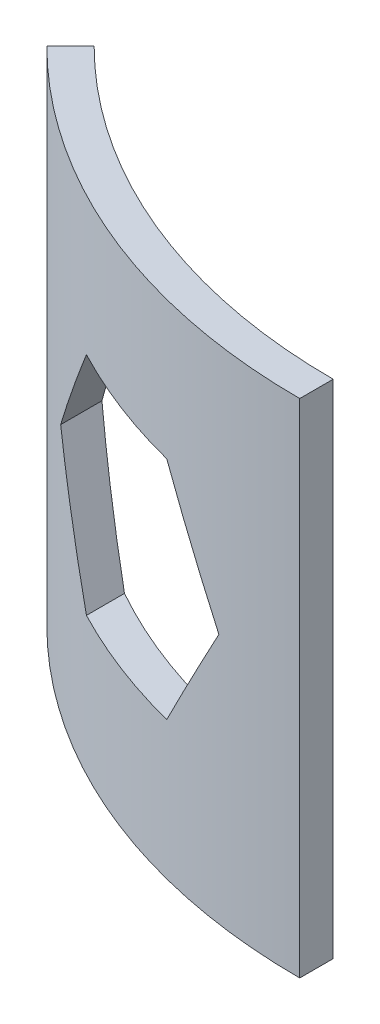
ISO-10303-21;
HEADER;
FILE_DESCRIPTION(('STEP AP214'),'2;1');
FILE_NAME('part.step','',(''),(''),'','','');
FILE_SCHEMA(('AUTOMOTIVE_DESIGN { 1 0 10303 214 1 1 1 1 }'));
ENDSEC;
DATA;
#1=APPLICATION_CONTEXT('core data for automotive mechanical design processes');
#2=APPLICATION_PROTOCOL_DEFINITION('international standard','automotive_design',2000,#1);
#3=PRODUCT_CONTEXT('',#1,'mechanical');
#4=PRODUCT('Part','Part','',(#3));
#5=PRODUCT_RELATED_PRODUCT_CATEGORY('part','',(#4));
#6=PRODUCT_DEFINITION_FORMATION('','',#4);
#7=PRODUCT_DEFINITION_CONTEXT('part definition',#1,'design');
#8=PRODUCT_DEFINITION('design','',#6,#7);
#9=PRODUCT_DEFINITION_SHAPE('','',#8);
#10=(LENGTH_UNIT() NAMED_UNIT(*) SI_UNIT(.MILLI.,.METRE.));
#11=(NAMED_UNIT(*) PLANE_ANGLE_UNIT() SI_UNIT($,.RADIAN.));
#12=(NAMED_UNIT(*) SI_UNIT($,.STERADIAN.) SOLID_ANGLE_UNIT());
#13=UNCERTAINTY_MEASURE_WITH_UNIT(LENGTH_MEASURE(1.E-05),#10,'distance_accuracy_value','');
#14=(GEOMETRIC_REPRESENTATION_CONTEXT(3) GLOBAL_UNCERTAINTY_ASSIGNED_CONTEXT((#13)) GLOBAL_UNIT_ASSIGNED_CONTEXT((#10,
#11,#12)) REPRESENTATION_CONTEXT('',''));
#15=CARTESIAN_POINT('',(0.,0.,0.));
#16=DIRECTION('',(0.,0.,1.));
#17=DIRECTION('',(1.,0.,0.));
#18=AXIS2_PLACEMENT_3D('',#15,#16,#17);
#19=CARTESIAN_POINT('',(0.,3000.,0.));
#20=DIRECTION('',(0.,-1.,0.));
#21=DIRECTION('',(0.,0.,-1.));
#22=AXIS2_PLACEMENT_3D('',#19,#20,#21);
#23=CYLINDRICAL_SURFACE('',#22,3450.);
#24=CARTESIAN_POINT('',(0.,598.333950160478,0.));
#25=DIRECTION('',(0.866025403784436,0.500000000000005,0.));
#26=DIRECTION('',(0.500000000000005,-0.866025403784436,0.));
#27=AXIS2_PLACEMENT_3D('',#24,#25,#26);
#28=ELLIPSE('',#27,6899.99999999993,3450.);
#29=CARTESIAN_POINT('',(-910.288568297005,2175.,3327.74318757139));
#30=VERTEX_POINT('',#29);
#31=CARTESIAN_POINT('',(-520.577136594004,1500.,3410.49841589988));
#32=VERTEX_POINT('',#31);
#33=EDGE_CURVE('E265',#30,#32,#28,.T.);
#34=ORIENTED_EDGE('',*,*,#33,.F.);
#35=CARTESIAN_POINT('',(0.,2175.,0.));
#36=DIRECTION('',(0.,1.,0.));
#37=DIRECTION('',(-1.,0.,0.));
#38=AXIS2_PLACEMENT_3D('',#35,#36,#37);
#39=CIRCLE('',#38,3450.);
#40=CARTESIAN_POINT('',(-1689.711431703,2175.,3007.88551603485));
#41=VERTEX_POINT('',#40);
#42=EDGE_CURVE('E261',#41,#30,#39,.T.);
#43=ORIENTED_EDGE('',*,*,#42,.F.);
#44=CARTESIAN_POINT('',(0.,5101.66604983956,0.));
#45=DIRECTION('',(-0.86602540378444,0.499999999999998,0.));
#46=DIRECTION('',(-0.499999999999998,-0.86602540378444,0.));
#47=AXIS2_PLACEMENT_3D('',#44,#45,#46);
#48=ELLIPSE('',#47,6900.00000000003,3450.);
#49=CARTESIAN_POINT('',(-2079.42286340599,1500.,2752.90765467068));
#50=VERTEX_POINT('',#49);
#51=EDGE_CURVE('E259',#50,#41,#48,.T.);
#52=ORIENTED_EDGE('',*,*,#51,.F.);
#53=CARTESIAN_POINT('',(0.,-2101.66604983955,0.));
#54=DIRECTION('',(-0.866025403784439,-0.5,0.));
#55=DIRECTION('',(0.5,-0.866025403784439,0.));
#56=AXIS2_PLACEMENT_3D('',#53,#54,#55);
#57=ELLIPSE('',#56,6900.00000000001,3450.);
#58=CARTESIAN_POINT('',(-1689.711431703,825.,3007.88551603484));
#59=VERTEX_POINT('',#58);
#60=EDGE_CURVE('E269',#59,#50,#57,.T.);
#61=ORIENTED_EDGE('',*,*,#60,.F.);
#62=CARTESIAN_POINT('',(0.,825.000000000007,0.));
#63=DIRECTION('',(0.,-1.,0.));
#64=DIRECTION('',(1.,0.,0.));
#65=AXIS2_PLACEMENT_3D('',#62,#63,#64);
#66=CIRCLE('',#65,3450.);
#67=CARTESIAN_POINT('',(-910.288568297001,825.000000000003,3327.74318757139));
#68=VERTEX_POINT('',#67);
#69=EDGE_CURVE('E133',#68,#59,#66,.T.);
#70=ORIENTED_EDGE('',*,*,#69,.F.);
#71=CARTESIAN_POINT('',(0.,2401.66604983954,0.));
#72=DIRECTION('',(0.866025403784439,-0.5,0.));
#73=DIRECTION('',(-0.5,-0.866025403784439,0.));
#74=AXIS2_PLACEMENT_3D('',#71,#72,#73);
#75=ELLIPSE('',#74,6900.00000000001,3450.);
#76=EDGE_CURVE('E143',#32,#68,#75,.T.);
#77=ORIENTED_EDGE('',*,*,#76,.F.);
#78=EDGE_LOOP('',(#34,#43,#52,#61,#70,#77));
#79=FACE_BOUND('',#78,.T.);
#80=CARTESIAN_POINT('',(0.,0.,0.));
#81=DIRECTION('',(0.,1.,0.));
#82=DIRECTION('',(0.,0.,1.));
#83=AXIS2_PLACEMENT_3D('',#80,#81,#82);
#84=CIRCLE('',#83,3450.);
#85=CARTESIAN_POINT('',(-2439.51839509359,0.,2439.51839509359));
#86=VERTEX_POINT('',#85);
#87=CARTESIAN_POINT('',(0.,0.,3450.));
#88=VERTEX_POINT('',#87);
#89=EDGE_CURVE('E267',#86,#88,#84,.T.);
#90=ORIENTED_EDGE('',*,*,#89,.F.);
#91=DIRECTION('',(0.,-1.,0.));
#92=VECTOR('',#91,1.);
#93=CARTESIAN_POINT('',(-2439.51839509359,3000.,2439.51839509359));
#94=LINE('',#93,#92);
#95=CARTESIAN_POINT('',(-2439.51839509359,3000.,2439.51839509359));
#96=VERTEX_POINT('',#95);
#97=EDGE_CURVE('E11',#96,#86,#94,.T.);
#98=ORIENTED_EDGE('',*,*,#97,.F.);
#99=CARTESIAN_POINT('',(0.,3000.,0.));
#100=DIRECTION('',(0.,1.,0.));
#101=DIRECTION('',(0.,0.,1.));
#102=AXIS2_PLACEMENT_3D('',#99,#100,#101);
#103=CIRCLE('',#102,3450.);
#104=CARTESIAN_POINT('',(0.,3000.,3450.));
#105=VERTEX_POINT('',#104);
#106=EDGE_CURVE('E273',#96,#105,#103,.T.);
#107=ORIENTED_EDGE('',*,*,#106,.T.);
#108=DIRECTION('',(0.,-1.,0.));
#109=VECTOR('',#108,1.);
#110=CARTESIAN_POINT('',(0.,3000.,3450.));
#111=LINE('',#110,#109);
#112=EDGE_CURVE('E284',#105,#88,#111,.T.);
#113=ORIENTED_EDGE('',*,*,#112,.T.);
#114=EDGE_LOOP('',(#90,#98,#107,#113));
#115=FACE_BOUND('',#114,.T.);
#116=ADVANCED_FACE('F35',(#79,#115),#23,.F.);
#117=CARTESIAN_POINT('',(0.,3000.,0.));
#118=DIRECTION('',(0.707106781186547,0.,0.707106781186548));
#119=DIRECTION('',(0.707106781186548,0.,-0.707106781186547));
#120=AXIS2_PLACEMENT_3D('',#117,#118,#119);
#121=PLANE('',#120);
#122=DIRECTION('',(-0.707106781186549,0.,0.707106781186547));
#123=VECTOR('',#122,1.);
#124=CARTESIAN_POINT('',(0.,0.,0.));
#125=LINE('',#124,#123);
#126=CARTESIAN_POINT('',(-2580.9397513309,0.,2580.93975133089));
#127=VERTEX_POINT('',#126);
#128=EDGE_CURVE('E287',#86,#127,#125,.T.);
#129=ORIENTED_EDGE('',*,*,#128,.T.);
#130=DIRECTION('',(0.,-1.,0.));
#131=VECTOR('',#130,1.);
#132=CARTESIAN_POINT('',(-2580.9397513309,3000.,2580.93975133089));
#133=LINE('',#132,#131);
#134=CARTESIAN_POINT('',(-2580.9397513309,3000.,2580.93975133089));
#135=VERTEX_POINT('',#134);
#136=EDGE_CURVE('E45',#135,#127,#133,.T.);
#137=ORIENTED_EDGE('',*,*,#136,.F.);
#138=DIRECTION('',(-0.707106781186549,0.,0.707106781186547));
#139=VECTOR('',#138,1.);
#140=CARTESIAN_POINT('',(0.,3000.,0.));
#141=LINE('',#140,#139);
#142=EDGE_CURVE('E276',#96,#135,#141,.T.);
#143=ORIENTED_EDGE('',*,*,#142,.F.);
#144=ORIENTED_EDGE('',*,*,#97,.T.);
#145=EDGE_LOOP('',(#129,#137,#143,#144));
#146=FACE_BOUND('',#145,.T.);
#147=ADVANCED_FACE('F180',(#146),#121,.F.);
#148=CARTESIAN_POINT('',(0.,3000.,0.));
#149=DIRECTION('',(0.,-1.,0.));
#150=DIRECTION('',(0.,0.,-1.));
#151=AXIS2_PLACEMENT_3D('',#148,#149,#150);
#152=CYLINDRICAL_SURFACE('',#151,3650.);
#153=CARTESIAN_POINT('',(0.,2175.,0.));
#154=DIRECTION('',(0.,1.,0.));
#155=DIRECTION('',(0.,0.,1.));
#156=AXIS2_PLACEMENT_3D('',#153,#154,#155);
#157=CIRCLE('',#156,3650.);
#158=CARTESIAN_POINT('',(-1689.711431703,2175.,3235.33232876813));
#159=VERTEX_POINT('',#158);
#160=CARTESIAN_POINT('',(-910.288568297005,2175.,3534.66755472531));
#161=VERTEX_POINT('',#160);
#162=EDGE_CURVE('E200',#159,#161,#157,.T.);
#163=ORIENTED_EDGE('',*,*,#162,.T.);
#164=CARTESIAN_POINT('',(-910.288568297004,2175.,3534.66755472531));
#165=CARTESIAN_POINT('',(-902.373529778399,2161.29074530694,3536.70592604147));
#166=CARTESIAN_POINT('',(-894.456700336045,2147.57837923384,3538.71641189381));
#167=CARTESIAN_POINT('',(-878.534582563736,2120.00043409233,3542.70307281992));
#168=CARTESIAN_POINT('',(-870.52925667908,2106.13479000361,3544.6786481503));
#169=CARTESIAN_POINT('',(-854.430133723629,2078.25028967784,3548.59387651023));
#170=CARTESIAN_POINT('',(-846.336299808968,2064.23136988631,3550.53292537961));
#171=CARTESIAN_POINT('',(-830.060168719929,2036.04031610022,3554.373470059));
#172=CARTESIAN_POINT('',(-821.877835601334,2021.86811993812,3556.27435723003));
#173=CARTESIAN_POINT('',(-805.741931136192,1993.91991180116,3559.96439309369));
#174=CARTESIAN_POINT('',(-797.788453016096,1980.14406249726,3561.75518182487));
#175=CARTESIAN_POINT('',(-781.7839391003,1952.42339650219,3565.30249069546));
#176=CARTESIAN_POINT('',(-773.73286670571,1938.47851651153,3567.05835108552));
#177=CARTESIAN_POINT('',(-757.533152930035,1910.41978824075,3570.53398712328));
#178=CARTESIAN_POINT('',(-749.384475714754,1896.30587820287,3572.25309715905));
#179=CARTESIAN_POINT('',(-732.989560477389,1867.90908818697,3575.65339538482));
#180=CARTESIAN_POINT('',(-724.7432875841,1853.62614792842,3577.33391206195));
#181=CARTESIAN_POINT('',(-708.517290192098,1825.52189362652,3580.58227854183));
#182=CARTESIAN_POINT('',(-700.537659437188,1811.70074353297,3582.15201551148));
#183=CARTESIAN_POINT('',(-684.468750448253,1783.86853684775,3585.2573669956));
#184=CARTESIAN_POINT('',(-676.379436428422,1769.85741839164,3586.79224191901));
#185=CARTESIAN_POINT('',(-660.09114793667,1741.64527404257,3589.82579089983));
#186=CARTESIAN_POINT('',(-651.892138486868,1727.44418796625,3591.32371741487));
#187=CARTESIAN_POINT('',(-635.384468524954,1698.85210661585,3594.28126399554));
#188=CARTESIAN_POINT('',(-627.075774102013,1684.46105276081,3595.74012852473));
#189=CARTESIAN_POINT('',(-610.774089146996,1656.22570291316,3598.54425703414));
#190=CARTESIAN_POINT('',(-602.781192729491,1642.38157208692,3599.89173190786));
#191=CARTESIAN_POINT('',(-586.669099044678,1614.47456014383,3602.55285442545));
#192=CARTESIAN_POINT('',(-578.5498666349,1600.41161830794,3603.86565263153));
#193=CARTESIAN_POINT('',(-562.185084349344,1572.06698410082,3606.4549912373));
#194=CARTESIAN_POINT('',(-553.939500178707,1557.78523291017,3607.73067100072));
#195=CARTESIAN_POINT('',(-537.322030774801,1529.00297520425,3610.24330282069));
#196=CARTESIAN_POINT('',(-528.950112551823,1514.50241161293,3611.47938295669));
#197=CARTESIAN_POINT('',(-520.577136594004,1500.00000000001,3612.68590453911));
#198=B_SPLINE_CURVE_WITH_KNOTS('',3,(#164,#165,#166,#167,#168,#169,#170,#171,#172,#173,#174,
#175,#176,#177,#178,#179,#180,#181,#182,#183,#184,#185,#186,#187,#188,#189,#190,#191,#192,#193,
#194,#195,#196,#197),.UNSPECIFIED.,.F.,.F.,(4,2,2,2,2,2,2,2,2,2,2,2,2,2,2,2,4),(0.,
47.8823104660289,96.2784696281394,145.188503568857,194.612437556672,242.634720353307,
291.22744321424,340.39062642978,390.124289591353,438.23308192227,486.986840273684,
536.385579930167,586.429315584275,634.55674557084,683.431032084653,733.052186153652,
783.420218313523),.UNSPECIFIED.);
#199=CARTESIAN_POINT('',(-520.577136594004,1500.,3612.68590453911));
#200=VERTEX_POINT('',#199);
#201=EDGE_CURVE('E199',#161,#200,#198,.T.);
#202=ORIENTED_EDGE('',*,*,#201,.T.);
#203=CARTESIAN_POINT('',(-520.577136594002,1500.,3612.68590453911));
#204=CARTESIAN_POINT('',(-528.950073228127,1485.49765650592,3611.4793886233));
#205=CARTESIAN_POINT('',(-537.32195217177,1470.99716103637,3610.24331442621));
#206=CARTESIAN_POINT('',(-553.939369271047,1442.21499415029,3607.73069106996));
#207=CARTESIAN_POINT('',(-562.18494040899,1427.93326566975,3606.45501364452));
#208=CARTESIAN_POINT('',(-578.54972281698,1399.58863146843,3603.86567574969));
#209=CARTESIAN_POINT('',(-586.668968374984,1385.52566694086,3602.55287573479));
#210=CARTESIAN_POINT('',(-602.781114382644,1357.61856415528,3599.89174511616));
#211=CARTESIAN_POINT('',(-610.774049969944,1343.77436519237,3598.54426377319));
#212=CARTESIAN_POINT('',(-627.075700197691,1315.53907498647,3595.74014123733));
#213=CARTESIAN_POINT('',(-635.384320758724,1301.14814885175,3594.2812899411));
#214=CARTESIAN_POINT('',(-651.89189241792,1272.55623779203,3591.32376202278));
#215=CARTESIAN_POINT('',(-660.090877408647,1258.3551943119,3589.82584058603));
#216=CARTESIAN_POINT('',(-676.379166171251,1230.14304997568,3586.79229294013));
#217=CARTESIAN_POINT('',(-684.46850490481,1216.13188896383,3585.25741392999));
#218=CARTESIAN_POINT('',(-700.537512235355,1188.29951193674,3582.15204446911));
#219=CARTESIAN_POINT('',(-708.51721660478,1174.47823408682,3580.58229327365));
#220=CARTESIAN_POINT('',(-724.743214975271,1146.37397756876,3577.33392659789));
#221=CARTESIAN_POINT('',(-732.98941528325,1132.09116276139,3575.6534249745));
#222=CARTESIAN_POINT('',(-749.38423395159,1103.69454001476,3572.25314781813));
#223=CARTESIAN_POINT('',(-757.532887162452,1089.58067182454,3570.53404345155));
#224=CARTESIAN_POINT('',(-773.732601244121,1061.52194356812,3567.05840872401));
#225=CARTESIAN_POINT('',(-781.783697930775,1047.57702177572,3565.30254363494));
#226=CARTESIAN_POINT('',(-797.788308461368,1019.85618845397,3561.75521437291));
#227=CARTESIAN_POINT('',(-805.741858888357,1006.08021365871,3559.96440961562));
#228=CARTESIAN_POINT('',(-821.877801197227,978.131939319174,3556.27436509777));
#229=CARTESIAN_POINT('',(-830.060099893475,963.959802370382,3554.37348604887));
#230=CARTESIAN_POINT('',(-846.336185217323,935.768827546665,3550.53295266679));
#231=CARTESIAN_POINT('',(-854.43000777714,921.749927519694,3548.59390680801));
#232=CARTESIAN_POINT('',(-870.529130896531,893.865427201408,3544.67867906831));
#233=CARTESIAN_POINT('',(-878.534468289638,879.999763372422,3542.70310118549));
#234=CARTESIAN_POINT('',(-894.456631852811,852.421739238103,3538.71642928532));
#235=CARTESIAN_POINT('',(-902.373495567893,838.709313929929,3536.70593485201));
#236=CARTESIAN_POINT('',(-910.288568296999,825.000000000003,3534.66755472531));
#237=B_SPLINE_CURVE_WITH_KNOTS('',3,(#203,#204,#205,#206,#207,#208,#209,#210,#211,#212,#213,
#214,#215,#216,#217,#218,#219,#220,#221,#222,#223,#224,#225,#226,#227,#228,#229,#230,#231,#232,
#233,#234,#235,#236),.UNSPECIFIED.,.F.,.F.,(4,2,2,2,2,2,2,2,2,2,2,2,2,2,2,2,4),(0.,
50.3677955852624,99.9888707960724,148.863236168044,196.990902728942,247.034193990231,
296.432785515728,345.186691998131,393.295928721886,443.029154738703,492.192192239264,
540.785060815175,588.80778075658,638.231507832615,687.141472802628,735.537700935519,
783.420218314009),.UNSPECIFIED.);
#238=CARTESIAN_POINT('',(-910.288568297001,825.000000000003,3534.66755472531));
#239=VERTEX_POINT('',#238);
#240=EDGE_CURVE('E140',#200,#239,#237,.T.);
#241=ORIENTED_EDGE('',*,*,#240,.T.);
#242=CARTESIAN_POINT('',(0.,825.,0.));
#243=DIRECTION('',(0.,-1.,0.));
#244=DIRECTION('',(1.,0.,0.));
#245=AXIS2_PLACEMENT_3D('',#242,#243,#244);
#246=CIRCLE('',#245,3650.);
#247=CARTESIAN_POINT('',(-1689.711431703,825.,3235.33232876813));
#248=VERTEX_POINT('',#247);
#249=EDGE_CURVE('E130',#239,#248,#246,.T.);
#250=ORIENTED_EDGE('',*,*,#249,.T.);
#251=CARTESIAN_POINT('',(-1689.711431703,825.,3235.33232876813));
#252=CARTESIAN_POINT('',(-1698.17448306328,839.658430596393,3230.91234217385));
#253=CARTESIAN_POINT('',(-1706.63237423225,854.307915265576,3226.4527928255));
#254=CARTESIAN_POINT('',(-1723.4727558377,883.476288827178,3217.48845473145));
#255=CARTESIAN_POINT('',(-1731.85532729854,897.995318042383,3212.98427475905));
#256=CARTESIAN_POINT('',(-1748.54506015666,926.902782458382,3203.93189645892));
#257=CARTESIAN_POINT('',(-1756.85230410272,941.291360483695,3199.38430645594));
#258=CARTESIAN_POINT('',(-1773.39138754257,969.93791853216,3190.24631534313));
#259=CARTESIAN_POINT('',(-1781.62331103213,984.196043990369,3185.65652219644));
#260=CARTESIAN_POINT('',(-1798.16576947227,1012.84842415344,3176.34867661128));
#261=CARTESIAN_POINT('',(-1806.47618468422,1027.24247113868,3171.6297718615));
#262=CARTESIAN_POINT('',(-1823.02307366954,1055.9025001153,3162.1475480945));
#263=CARTESIAN_POINT('',(-1831.25963353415,1070.1686311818,3157.38482990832));
#264=CARTESIAN_POINT('',(-1847.65880348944,1098.572826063,3147.81612953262));
#265=CARTESIAN_POINT('',(-1855.82150126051,1112.71104161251,3143.01074806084));
#266=CARTESIAN_POINT('',(-1872.07295165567,1140.85940242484,3133.35786389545));
#267=CARTESIAN_POINT('',(-1880.16179349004,1154.86970215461,3128.5109618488));
#268=CARTESIAN_POINT('',(-1896.40618019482,1183.00580683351,3118.69115978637));
#269=CARTESIAN_POINT('',(-1904.56160932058,1197.13141103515,3113.71749304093));
#270=CARTESIAN_POINT('',(-1920.79966762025,1225.25653106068,3103.72660448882));
#271=CARTESIAN_POINT('',(-1928.8823884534,1239.25620560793,3098.7099784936));
#272=CARTESIAN_POINT('',(-1944.97502208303,1267.1294639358,3088.63426341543));
#273=CARTESIAN_POINT('',(-1952.98502821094,1281.00320924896,3083.57577029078));
#274=CARTESIAN_POINT('',(-1968.93223655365,1308.62460590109,3073.41740604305));
#275=CARTESIAN_POINT('',(-1976.86953372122,1322.37242165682,3068.31813106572));
#276=CARTESIAN_POINT('',(-1992.7999448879,1349.96470487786,3057.99595142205));
#277=CARTESIAN_POINT('',(-2000.79294755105,1363.80897927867,3052.77235878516));
#278=CARTESIAN_POINT('',(-2016.70702923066,1391.37295701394,3042.28251721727));
#279=CARTESIAN_POINT('',(-2024.62820601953,1405.09282966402,3037.01686154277));
#280=CARTESIAN_POINT('',(-2040.39862838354,1432.40800265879,3026.44393576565));
#281=CARTESIAN_POINT('',(-2048.24797349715,1446.00347529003,3021.137259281));
#282=CARTESIAN_POINT('',(-2063.87473608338,1473.06983995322,3010.4833211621));
#283=CARTESIAN_POINT('',(-2071.65225482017,1486.54090736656,3005.13665359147));
#284=CARTESIAN_POINT('',(-2079.42286340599,1500.,2999.75008211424));
#285=B_SPLINE_CURVE_WITH_KNOTS('',3,(#251,#252,#253,#254,#255,#256,#257,#258,#259,#260,#261,
#262,#263,#264,#265,#266,#267,#268,#269,#270,#271,#272,#273,#274,#275,#276,#277,#278,#279,#280,
#281,#282,#283,#284),.UNSPECIFIED.,.F.,.F.,(4,2,2,2,2,2,2,2,2,2,2,2,2,2,2,2,4),(0.,
52.4810201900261,104.559771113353,156.236446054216,207.511242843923,259.344206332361,
310.787395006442,361.841032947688,412.5053494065,463.662054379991,514.439699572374,
564.838543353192,614.858849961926,665.311993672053,715.395346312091,765.109204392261,
814.453871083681),.UNSPECIFIED.);
#286=CARTESIAN_POINT('',(-2079.42286340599,1500.,2999.75008211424));
#287=VERTEX_POINT('',#286);
#288=EDGE_CURVE('E114',#248,#287,#285,.T.);
#289=ORIENTED_EDGE('',*,*,#288,.T.);
#290=CARTESIAN_POINT('',(-2079.42286340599,1500.,2999.75008211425));
#291=CARTESIAN_POINT('',(-2071.65229052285,1513.45903084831,3005.13662884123));
#292=CARTESIAN_POINT('',(-2063.87480769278,1526.9300364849,3010.48327193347));
#293=CARTESIAN_POINT('',(-2048.24809329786,1553.99631872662,3021.13717801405));
#294=CARTESIAN_POINT('',(-2040.39876042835,1567.59177078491,3026.44384669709));
#295=CARTESIAN_POINT('',(-2024.62833860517,1594.90694381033,3037.01677319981));
#296=CARTESIAN_POINT('',(-2016.70715007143,1608.6268371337,3042.28243715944));
#297=CARTESIAN_POINT('',(-2000.79302030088,1636.19089716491,3052.77231123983));
#298=CARTESIAN_POINT('',(-1992.79998124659,1650.03523325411,3057.99592786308));
#299=CARTESIAN_POINT('',(-1976.86960780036,1677.62744893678,3068.31808306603));
#300=CARTESIAN_POINT('',(-1968.93238492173,1691.3751351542,3073.41731072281));
#301=CARTESIAN_POINT('',(-1952.98527633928,1718.99635906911,3083.57561304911));
#302=CARTESIAN_POINT('',(-1944.97529561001,1732.87006132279,3088.63409107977));
#303=CARTESIAN_POINT('',(-1928.88266302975,1760.7433197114,3098.70980766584));
#304=CARTESIAN_POINT('',(-1920.79991777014,1774.74303751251,3103.72644977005));
#305=CARTESIAN_POINT('',(-1904.56175989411,1802.86833003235,3113.71740121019));
#306=CARTESIAN_POINT('',(-1896.40625553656,1816.99406360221,3118.69111424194));
#307=CARTESIAN_POINT('',(-1880.1618686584,1845.13016672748,3128.51091640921));
#308=CARTESIAN_POINT('',(-1872.07310210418,1859.14033515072,3133.35777374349));
#309=CARTESIAN_POINT('',(-1855.82175277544,1887.28852088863,3143.01059946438));
#310=CARTESIAN_POINT('',(-1847.65908072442,1901.42669279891,3147.81596671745));
#311=CARTESIAN_POINT('',(-1831.25991176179,1929.83088773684,3157.38466862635));
#312=CARTESIAN_POINT('',(-1823.02332709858,1944.09706262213,3162.14740207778));
#313=CARTESIAN_POINT('',(-1806.47633721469,1972.75726644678,3171.62968524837));
#314=CARTESIAN_POINT('',(-1798.16584582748,1987.15144457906,3176.3486336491));
#315=CARTESIAN_POINT('',(-1781.62334983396,2015.80388782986,3185.6565003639));
#316=CARTESIAN_POINT('',(-1773.39146512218,2030.06194496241,3190.24627208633));
#317=CARTESIAN_POINT('',(-1756.85243376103,2058.70841194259,3199.38423521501));
#318=CARTESIAN_POINT('',(-1748.54520308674,2073.09696728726,3203.93181841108));
#319=CARTESIAN_POINT('',(-1731.85547070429,2102.00443172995,3212.98419750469));
#320=CARTESIAN_POINT('',(-1723.47288641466,2116.52348371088,3217.4883848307));
#321=CARTESIAN_POINT('',(-1706.63245281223,2145.6919482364,3226.45275139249));
#322=CARTESIAN_POINT('',(-1698.1745224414,2160.34150116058,3230.91232160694));
#323=CARTESIAN_POINT('',(-1689.711431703,2175.,3235.33232876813));
#324=B_SPLINE_CURVE_WITH_KNOTS('',3,(#290,#291,#292,#293,#294,#295,#296,#297,#298,#299,#300,
#301,#302,#303,#304,#305,#306,#307,#308,#309,#310,#311,#312,#313,#314,#315,#316,#317,#318,#319,
#320,#321,#322,#323),.UNSPECIFIED.,.F.,.F.,(4,2,2,2,2,2,2,2,2,2,2,2,2,2,2,2,4),(0.,
49.3444401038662,99.0582226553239,149.141650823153,199.595021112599,249.614857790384,
300.013544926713,350.7913467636,401.948521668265,452.612364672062,503.665844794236,
555.109191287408,606.942628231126,658.217180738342,709.89377425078,761.972606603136,
814.45387108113),.UNSPECIFIED.);
#325=EDGE_CURVE('E134',#287,#159,#324,.T.);
#326=ORIENTED_EDGE('',*,*,#325,.T.);
#327=EDGE_LOOP('',(#163,#202,#241,#250,#289,#326));
#328=FACE_BOUND('',#327,.T.);
#329=CARTESIAN_POINT('',(0.,0.,0.));
#330=DIRECTION('',(0.,1.,0.));
#331=DIRECTION('',(0.,0.,1.));
#332=AXIS2_PLACEMENT_3D('',#329,#330,#331);
#333=CIRCLE('',#332,3650.);
#334=CARTESIAN_POINT('',(0.,0.,3650.));
#335=VERTEX_POINT('',#334);
#336=EDGE_CURVE('E289',#127,#335,#333,.T.);
#337=ORIENTED_EDGE('',*,*,#336,.T.);
#338=DIRECTION('',(0.,-1.,0.));
#339=VECTOR('',#338,1.);
#340=CARTESIAN_POINT('',(0.,3000.,3650.));
#341=LINE('',#340,#339);
#342=CARTESIAN_POINT('',(0.,3000.,3650.));
#343=VERTEX_POINT('',#342);
#344=EDGE_CURVE('E295',#343,#335,#341,.T.);
#345=ORIENTED_EDGE('',*,*,#344,.F.);
#346=CARTESIAN_POINT('',(0.,3000.,0.));
#347=DIRECTION('',(0.,1.,0.));
#348=DIRECTION('',(0.,0.,1.));
#349=AXIS2_PLACEMENT_3D('',#346,#347,#348);
#350=CIRCLE('',#349,3650.);
#351=EDGE_CURVE('E279',#135,#343,#350,.T.);
#352=ORIENTED_EDGE('',*,*,#351,.F.);
#353=ORIENTED_EDGE('',*,*,#136,.T.);
#354=EDGE_LOOP('',(#337,#345,#352,#353));
#355=FACE_BOUND('',#354,.T.);
#356=ADVANCED_FACE('F137',(#328,#355),#152,.T.);
#357=CARTESIAN_POINT('',(0.,3000.,0.));
#358=DIRECTION('',(1.,0.,0.));
#359=DIRECTION('',(0.,0.,-1.));
#360=AXIS2_PLACEMENT_3D('',#357,#358,#359);
#361=PLANE('',#360);
#362=DIRECTION('',(0.,0.,1.));
#363=VECTOR('',#362,1.);
#364=CARTESIAN_POINT('',(0.,0.,0.));
#365=LINE('',#364,#363);
#366=EDGE_CURVE('E277',#88,#335,#365,.T.);
#367=ORIENTED_EDGE('',*,*,#366,.F.);
#368=ORIENTED_EDGE('',*,*,#112,.F.);
#369=DIRECTION('',(0.,0.,1.));
#370=VECTOR('',#369,1.);
#371=CARTESIAN_POINT('',(0.,3000.,0.));
#372=LINE('',#371,#370);
#373=EDGE_CURVE('E281',#105,#343,#372,.T.);
#374=ORIENTED_EDGE('',*,*,#373,.T.);
#375=ORIENTED_EDGE('',*,*,#344,.T.);
#376=EDGE_LOOP('',(#367,#368,#374,#375));
#377=FACE_BOUND('',#376,.T.);
#378=ADVANCED_FACE('F170',(#377),#361,.T.);
#379=CARTESIAN_POINT('',(0.,3000.,0.));
#380=DIRECTION('',(0.,1.,0.));
#381=DIRECTION('',(0.,0.,1.));
#382=AXIS2_PLACEMENT_3D('',#379,#380,#381);
#383=PLANE('',#382);
#384=ORIENTED_EDGE('',*,*,#106,.F.);
#385=ORIENTED_EDGE('',*,*,#142,.T.);
#386=ORIENTED_EDGE('',*,*,#351,.T.);
#387=ORIENTED_EDGE('',*,*,#373,.F.);
#388=EDGE_LOOP('',(#384,#385,#386,#387));
#389=FACE_BOUND('',#388,.T.);
#390=ADVANCED_FACE('F167',(#389),#383,.T.);
#391=CARTESIAN_POINT('',(0.,0.,0.));
#392=DIRECTION('',(0.,1.,0.));
#393=DIRECTION('',(0.,0.,1.));
#394=AXIS2_PLACEMENT_3D('',#391,#392,#393);
#395=PLANE('',#394);
#396=ORIENTED_EDGE('',*,*,#89,.T.);
#397=ORIENTED_EDGE('',*,*,#366,.T.);
#398=ORIENTED_EDGE('',*,*,#336,.F.);
#399=ORIENTED_EDGE('',*,*,#128,.F.);
#400=EDGE_LOOP('',(#396,#397,#398,#399));
#401=FACE_BOUND('',#400,.T.);
#402=ADVANCED_FACE('F165',(#401),#395,.F.);
#403=CARTESIAN_POINT('',(-520.577136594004,1500.,3612.68590453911));
#404=DIRECTION('',(0.866025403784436,0.500000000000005,0.));
#405=DIRECTION('',(-0.500000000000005,0.866025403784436,0.));
#406=AXIS2_PLACEMENT_3D('',#403,#404,#405);
#407=PLANE('',#406);
#408=ORIENTED_EDGE('',*,*,#33,.T.);
#409=DIRECTION('',(0.,0.,-1.));
#410=VECTOR('',#409,1.);
#411=CARTESIAN_POINT('',(-520.577136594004,1500.,3612.68590453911));
#412=LINE('',#411,#410);
#413=EDGE_CURVE('E53',#200,#32,#412,.T.);
#414=ORIENTED_EDGE('',*,*,#413,.F.);
#415=ORIENTED_EDGE('',*,*,#201,.F.);
#416=DIRECTION('',(0.,0.,-1.));
#417=VECTOR('',#416,1.);
#418=CARTESIAN_POINT('',(-910.288568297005,2175.,3534.66755472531));
#419=LINE('',#418,#417);
#420=EDGE_CURVE('E205',#161,#30,#419,.T.);
#421=ORIENTED_EDGE('',*,*,#420,.T.);
#422=EDGE_LOOP('',(#408,#414,#415,#421));
#423=FACE_BOUND('',#422,.T.);
#424=ADVANCED_FACE('F174',(#423),#407,.F.);
#425=CARTESIAN_POINT('',(-910.288568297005,2175.,3534.66755472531));
#426=DIRECTION('',(0.,1.,0.));
#427=DIRECTION('',(-1.,0.,0.));
#428=AXIS2_PLACEMENT_3D('',#425,#426,#427);
#429=PLANE('',#428);
#430=ORIENTED_EDGE('',*,*,#42,.T.);
#431=ORIENTED_EDGE('',*,*,#420,.F.);
#432=ORIENTED_EDGE('',*,*,#162,.F.);
#433=DIRECTION('',(0.,0.,-1.));
#434=VECTOR('',#433,1.);
#435=CARTESIAN_POINT('',(-1689.711431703,2175.,3235.33232876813));
#436=LINE('',#435,#434);
#437=EDGE_CURVE('E206',#159,#41,#436,.T.);
#438=ORIENTED_EDGE('',*,*,#437,.T.);
#439=EDGE_LOOP('',(#430,#431,#432,#438));
#440=FACE_BOUND('',#439,.T.);
#441=ADVANCED_FACE('F231',(#440),#429,.F.);
#442=CARTESIAN_POINT('',(-1689.711431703,2175.,3235.33232876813));
#443=DIRECTION('',(-0.86602540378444,0.499999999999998,0.));
#444=DIRECTION('',(-0.499999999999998,-0.86602540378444,0.));
#445=AXIS2_PLACEMENT_3D('',#442,#443,#444);
#446=PLANE('',#445);
#447=ORIENTED_EDGE('',*,*,#51,.T.);
#448=ORIENTED_EDGE('',*,*,#437,.F.);
#449=ORIENTED_EDGE('',*,*,#325,.F.);
#450=DIRECTION('',(0.,0.,-1.));
#451=VECTOR('',#450,1.);
#452=CARTESIAN_POINT('',(-2079.42286340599,1500.,2999.75008211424));
#453=LINE('',#452,#451);
#454=EDGE_CURVE('E121',#287,#50,#453,.T.);
#455=ORIENTED_EDGE('',*,*,#454,.T.);
#456=EDGE_LOOP('',(#447,#448,#449,#455));
#457=FACE_BOUND('',#456,.T.);
#458=ADVANCED_FACE('F233',(#457),#446,.F.);
#459=CARTESIAN_POINT('',(-2079.42286340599,1500.,2999.75008211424));
#460=DIRECTION('',(-0.866025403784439,-0.5,0.));
#461=DIRECTION('',(0.5,-0.866025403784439,0.));
#462=AXIS2_PLACEMENT_3D('',#459,#460,#461);
#463=PLANE('',#462);
#464=ORIENTED_EDGE('',*,*,#60,.T.);
#465=ORIENTED_EDGE('',*,*,#454,.F.);
#466=ORIENTED_EDGE('',*,*,#288,.F.);
#467=DIRECTION('',(0.,0.,-1.));
#468=VECTOR('',#467,1.);
#469=CARTESIAN_POINT('',(-1689.711431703,825.,3235.33232876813));
#470=LINE('',#469,#468);
#471=EDGE_CURVE('E118',#248,#59,#470,.T.);
#472=ORIENTED_EDGE('',*,*,#471,.T.);
#473=EDGE_LOOP('',(#464,#465,#466,#472));
#474=FACE_BOUND('',#473,.T.);
#475=ADVANCED_FACE('F117',(#474),#463,.F.);
#476=CARTESIAN_POINT('',(-1689.711431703,825.,3235.33232876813));
#477=DIRECTION('',(0.,-1.,0.));
#478=DIRECTION('',(1.,0.,0.));
#479=AXIS2_PLACEMENT_3D('',#476,#477,#478);
#480=PLANE('',#479);
#481=ORIENTED_EDGE('',*,*,#69,.T.);
#482=ORIENTED_EDGE('',*,*,#471,.F.);
#483=ORIENTED_EDGE('',*,*,#249,.F.);
#484=DIRECTION('',(0.,0.,-1.));
#485=VECTOR('',#484,1.);
#486=CARTESIAN_POINT('',(-910.288568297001,825.000000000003,3534.66755472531));
#487=LINE('',#486,#485);
#488=EDGE_CURVE('E58',#239,#68,#487,.T.);
#489=ORIENTED_EDGE('',*,*,#488,.T.);
#490=EDGE_LOOP('',(#481,#482,#483,#489));
#491=FACE_BOUND('',#490,.T.);
#492=ADVANCED_FACE('F129',(#491),#480,.F.);
#493=CARTESIAN_POINT('',(-910.288568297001,825.000000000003,3534.66755472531));
#494=DIRECTION('',(0.866025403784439,-0.5,0.));
#495=DIRECTION('',(0.5,0.866025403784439,0.));
#496=AXIS2_PLACEMENT_3D('',#493,#494,#495);
#497=PLANE('',#496);
#498=ORIENTED_EDGE('',*,*,#76,.T.);
#499=ORIENTED_EDGE('',*,*,#488,.F.);
#500=ORIENTED_EDGE('',*,*,#240,.F.);
#501=ORIENTED_EDGE('',*,*,#413,.T.);
#502=EDGE_LOOP('',(#498,#499,#500,#501));
#503=FACE_BOUND('',#502,.T.);
#504=ADVANCED_FACE('F155',(#503),#497,.F.);
#505=CLOSED_SHELL('',(#116,#147,#356,#378,#390,#402,#424,#441,#458,#475,#492,#504));
#506=MANIFOLD_SOLID_BREP('B2',#505);
#507=ADVANCED_BREP_SHAPE_REPRESENTATION('',(#18,#506),#14);
#508=SHAPE_DEFINITION_REPRESENTATION(#9,#507);
ENDSEC;
END-ISO-10303-21;
